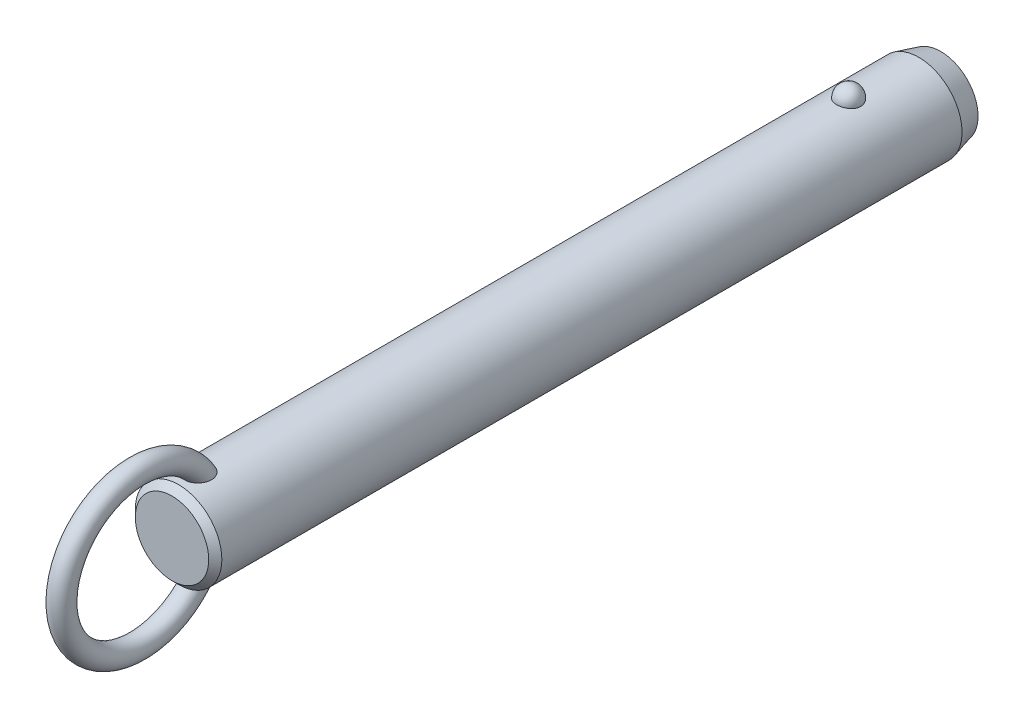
ISO-10303-21;
HEADER;
FILE_DESCRIPTION(('STEP AP214'),'2;1');
FILE_NAME('part.step','',(''),(''),'','','');
FILE_SCHEMA(('AUTOMOTIVE_DESIGN { 1 0 10303 214 1 1 1 1 }'));
ENDSEC;
DATA;
#1=APPLICATION_CONTEXT('core data for automotive mechanical design processes');
#2=APPLICATION_PROTOCOL_DEFINITION('international standard','automotive_design',2000,#1);
#3=PRODUCT_CONTEXT('',#1,'mechanical');
#4=PRODUCT('Part','Part','',(#3));
#5=PRODUCT_RELATED_PRODUCT_CATEGORY('part','',(#4));
#6=PRODUCT_DEFINITION_FORMATION('','',#4);
#7=PRODUCT_DEFINITION_CONTEXT('part definition',#1,'design');
#8=PRODUCT_DEFINITION('design','',#6,#7);
#9=PRODUCT_DEFINITION_SHAPE('','',#8);
#10=(LENGTH_UNIT() NAMED_UNIT(*) SI_UNIT(.MILLI.,.METRE.));
#11=(NAMED_UNIT(*) PLANE_ANGLE_UNIT() SI_UNIT($,.RADIAN.));
#12=(NAMED_UNIT(*) SI_UNIT($,.STERADIAN.) SOLID_ANGLE_UNIT());
#13=UNCERTAINTY_MEASURE_WITH_UNIT(LENGTH_MEASURE(1.E-05),#10,'distance_accuracy_value','');
#14=(GEOMETRIC_REPRESENTATION_CONTEXT(3) GLOBAL_UNCERTAINTY_ASSIGNED_CONTEXT((#13)) GLOBAL_UNIT_ASSIGNED_CONTEXT((#10,
#11,#12)) REPRESENTATION_CONTEXT('',''));
#15=CARTESIAN_POINT('',(0.,0.,0.));
#16=DIRECTION('',(0.,0.,1.));
#17=DIRECTION('',(1.,0.,0.));
#18=AXIS2_PLACEMENT_3D('',#15,#16,#17);
#19=CARTESIAN_POINT('',(0.,0.,111.8));
#20=DIRECTION('',(0.,0.,-1.));
#21=DIRECTION('',(-1.,0.,0.));
#22=AXIS2_PLACEMENT_3D('',#19,#20,#21);
#23=CYLINDRICAL_SURFACE('',#22,7.9);
#24=CARTESIAN_POINT('',(2.1785689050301,7.59367088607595,-2.19999999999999));
#25=CARTESIAN_POINT('',(2.17856679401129,7.59367269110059,-2.07701843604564));
#26=CARTESIAN_POINT('',(2.16853481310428,7.59657145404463,-1.95401006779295));
#27=CARTESIAN_POINT('',(2.12864689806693,7.607843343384,-1.71147811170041));
#28=CARTESIAN_POINT('',(2.09878338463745,7.61621856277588,-1.59195587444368));
#29=CARTESIAN_POINT('',(2.0199931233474,7.63749180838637,-1.3598563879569));
#30=CARTESIAN_POINT('',(1.97107475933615,7.6503878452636,-1.24727610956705));
#31=CARTESIAN_POINT('',(1.85539377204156,7.67926115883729,-1.03213234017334));
#32=CARTESIAN_POINT('',(1.78863158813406,7.69523835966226,-0.929568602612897));
#33=CARTESIAN_POINT('',(1.63856494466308,7.7285848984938,-0.736786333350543));
#34=CARTESIAN_POINT('',(1.55518140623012,7.7459606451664,-0.646630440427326));
#35=CARTESIAN_POINT('',(1.37422937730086,7.78009978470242,-0.481747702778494));
#36=CARTESIAN_POINT('',(1.27666086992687,7.79686317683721,-0.407020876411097));
#37=CARTESIAN_POINT('',(1.07024728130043,7.82786153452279,-0.275278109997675));
#38=CARTESIAN_POINT('',(0.961434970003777,7.84210353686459,-0.218212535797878));
#39=CARTESIAN_POINT('',(0.735351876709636,7.86652194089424,-0.123146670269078));
#40=CARTESIAN_POINT('',(0.618082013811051,7.87669878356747,-0.085144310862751));
#41=CARTESIAN_POINT('',(0.380637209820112,7.89170521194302,-0.0298158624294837));
#42=CARTESIAN_POINT('',(0.260550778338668,7.89662650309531,-0.0121347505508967));
#43=CARTESIAN_POINT('',(0.0190117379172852,7.90090003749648,0.00324379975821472));
#44=CARTESIAN_POINT('',(-0.102440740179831,7.90025280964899,0.00094313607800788));
#45=CARTESIAN_POINT('',(-0.341452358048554,7.89351056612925,-0.0233955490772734));
#46=CARTESIAN_POINT('',(-0.459042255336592,7.88749257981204,-0.0451545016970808));
#47=CARTESIAN_POINT('',(-0.688796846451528,7.87075812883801,-0.107408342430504));
#48=CARTESIAN_POINT('',(-0.800961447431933,7.86004158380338,-0.147903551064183));
#49=CARTESIAN_POINT('',(-1.01743634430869,7.83497131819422,-0.246799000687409));
#50=CARTESIAN_POINT('',(-1.12169791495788,7.82059709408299,-0.305300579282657));
#51=CARTESIAN_POINT('',(-1.31891765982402,7.78976470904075,-0.438549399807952));
#52=CARTESIAN_POINT('',(-1.41187469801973,7.77330633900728,-0.513298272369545));
#53=CARTESIAN_POINT('',(-1.58577142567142,7.73972434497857,-0.678622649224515));
#54=CARTESIAN_POINT('',(-1.66645140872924,7.72259402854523,-0.769470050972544));
#55=CARTESIAN_POINT('',(-1.81161503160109,7.68983776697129,-0.963538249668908));
#56=CARTESIAN_POINT('',(-1.87609753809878,7.6742119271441,-1.06675991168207));
#57=CARTESIAN_POINT('',(-1.98790138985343,7.6460202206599,-1.28401170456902));
#58=CARTESIAN_POINT('',(-2.03501994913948,7.63349104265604,-1.39815107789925));
#59=CARTESIAN_POINT('',(-2.10986724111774,7.6131449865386,-1.63301784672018));
#60=CARTESIAN_POINT('',(-2.1375965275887,7.60532797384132,-1.75374505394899));
#61=CARTESIAN_POINT('',(-2.17289256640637,7.5953195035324,-1.99782562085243));
#62=CARTESIAN_POINT('',(-2.18054294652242,7.59310471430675,-2.12116592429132));
#63=CARTESIAN_POINT('',(-2.17572919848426,7.59448538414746,-2.36741799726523));
#64=CARTESIAN_POINT('',(-2.1632656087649,7.59808068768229,-2.49032977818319));
#65=CARTESIAN_POINT('',(-2.11865035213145,7.61064035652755,-2.73161015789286));
#66=CARTESIAN_POINT('',(-2.08659579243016,7.61957823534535,-2.84999812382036));
#67=CARTESIAN_POINT('',(-2.00367799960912,7.64179982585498,-3.07955956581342));
#68=CARTESIAN_POINT('',(-1.9528140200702,7.65508371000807,-3.19073275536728));
#69=CARTESIAN_POINT('',(-1.83321113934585,7.68460381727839,-3.40337899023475));
#70=CARTESIAN_POINT('',(-1.76437735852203,7.70085556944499,-3.50479651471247));
#71=CARTESIAN_POINT('',(-1.61069526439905,7.73445734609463,-3.69446912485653));
#72=CARTESIAN_POINT('',(-1.52584634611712,7.75180741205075,-3.78272371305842));
#73=CARTESIAN_POINT('',(-1.34198059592,7.78574608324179,-3.94393987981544));
#74=CARTESIAN_POINT('',(-1.24291308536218,7.80233167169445,-4.01684434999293));
#75=CARTESIAN_POINT('',(-1.03352039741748,7.83281625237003,-4.14489386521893));
#76=CARTESIAN_POINT('',(-0.92319600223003,7.84671543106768,-4.20004014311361));
#77=CARTESIAN_POINT('',(-0.695822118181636,7.87011575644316,-4.29042017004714));
#78=CARTESIAN_POINT('',(-0.578872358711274,7.87966903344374,-4.32589112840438));
#79=CARTESIAN_POINT('',(-0.340410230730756,7.8935652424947,-4.37692226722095));
#80=CARTESIAN_POINT('',(-0.218898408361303,7.89790879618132,-4.39248482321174));
#81=CARTESIAN_POINT('',(0.0228107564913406,7.90087453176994,-4.40314405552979));
#82=CARTESIAN_POINT('',(0.142990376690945,7.89960185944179,-4.39861683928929));
#83=CARTESIAN_POINT('',(0.380829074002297,7.89171262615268,-4.37008293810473));
#84=CARTESIAN_POINT('',(0.498488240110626,7.8850962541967,-4.34607694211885));
#85=CARTESIAN_POINT('',(0.727535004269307,7.86726442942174,-4.27939317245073));
#86=CARTESIAN_POINT('',(0.838944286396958,7.85606616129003,-4.236785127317));
#87=CARTESIAN_POINT('',(1.05295421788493,7.83025654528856,-4.13408348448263));
#88=CARTESIAN_POINT('',(1.15555431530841,7.81564498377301,-4.07398879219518));
#89=CARTESIAN_POINT('',(1.35076763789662,7.7843022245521,-3.93687432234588));
#90=CARTESIAN_POINT('',(1.4432046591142,7.76754209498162,-3.85961036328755));
#91=CARTESIAN_POINT('',(1.6139111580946,7.73387857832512,-3.69076949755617));
#92=CARTESIAN_POINT('',(1.6921781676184,7.71697516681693,-3.59919010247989));
#93=CARTESIAN_POINT('',(1.83380875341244,7.6845643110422,-3.40247278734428));
#94=CARTESIAN_POINT('',(1.89689280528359,7.66908588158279,-3.29712873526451));
#95=CARTESIAN_POINT('',(2.0047823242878,7.64159441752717,-3.07707931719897));
#96=CARTESIAN_POINT('',(2.0495945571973,7.62958010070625,-2.96237743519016));
#97=CARTESIAN_POINT('',(2.11580183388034,7.61146617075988,-2.74040519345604));
#98=CARTESIAN_POINT('',(2.13929812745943,7.60484503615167,-2.63379846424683));
#99=CARTESIAN_POINT('',(2.17068242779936,7.59594664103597,-2.41813481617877));
#100=CARTESIAN_POINT('',(2.17857077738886,7.59366928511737,-2.30907795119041));
#101=CARTESIAN_POINT('',(2.1785689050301,7.59367088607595,-2.19999999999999));
#102=B_SPLINE_CURVE_WITH_KNOTS('',3,(#24,#25,#26,#27,#28,#29,#30,#31,#32,#33,#34,#35,#36,#37,
#38,#39,#40,#41,#42,#43,#44,#45,#46,#47,#48,#49,#50,#51,#52,#53,#54,#55,#56,#57,#58,#59,#60,#61,
#62,#63,#64,#65,#66,#67,#68,#69,#70,#71,#72,#73,#74,#75,#76,#77,#78,#79,#80,#81,#82,#83,#84,#85,
#86,#87,#88,#89,#90,#91,#92,#93,#94,#95,#96,#97,#98,#99,#100,#101),.UNSPECIFIED.,.T.,.F.,(4,2,2,
2,2,2,2,2,2,2,2,2,2,2,2,2,2,2,2,2,2,2,2,2,2,2,2,2,2,2,2,2,2,2,2,2,2,2,4),(0.,0.368552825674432,
0.737246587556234,1.10577831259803,1.4743009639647,1.8446206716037,2.21494081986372,
2.5842105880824,2.95344028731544,3.31611630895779,3.67875788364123,4.03628044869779,
4.39380913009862,4.75338791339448,5.11300280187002,5.47939989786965,5.8458226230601,
6.21639834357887,6.58696347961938,6.95598276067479,7.32499216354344,7.69218715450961,
8.0593967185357,8.42858578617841,8.79778880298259,9.16834203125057,9.5388695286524,
9.90482699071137,10.2707407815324,10.6298333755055,10.9889132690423,11.3466585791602,
11.7044262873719,12.0676511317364,12.4309391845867,12.8004764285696,13.1698767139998,
13.4967701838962,13.8236564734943),.UNSPECIFIED.);
#103=CARTESIAN_POINT('',(2.1785689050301,7.59367088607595,-2.19999999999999));
#104=VERTEX_POINT('',#103);
#105=EDGE_CURVE('E41',#104,#104,#102,.T.);
#106=ORIENTED_EDGE('',*,*,#105,.T.);
#107=EDGE_LOOP('',(#106));
#108=FACE_BOUND('',#107,.T.);
#109=CARTESIAN_POINT('',(0.,0.,120.12));
#110=DIRECTION('',(0.,0.,1.));
#111=DIRECTION('',(1.,0.,0.));
#112=AXIS2_PLACEMENT_3D('',#109,#110,#111);
#113=CIRCLE('',#112,7.9);
#114=CARTESIAN_POINT('',(7.9,0.,120.12));
#115=VERTEX_POINT('',#114);
#116=EDGE_CURVE('E10',#115,#115,#113,.F.);
#117=ORIENTED_EDGE('',*,*,#116,.T.);
#118=EDGE_LOOP('',(#117));
#119=FACE_BOUND('',#118,.T.);
#120=CARTESIAN_POINT('',(-0.630969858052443,-7.87476203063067,114.012432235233));
#121=CARTESIAN_POINT('',(-0.734180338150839,-7.8664899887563,114.047285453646));
#122=CARTESIAN_POINT('',(-0.834476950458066,-7.85639291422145,114.090816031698));
#123=CARTESIAN_POINT('',(-1.0262035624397,-7.83366343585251,114.194094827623));
#124=CARTESIAN_POINT('',(-1.1176141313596,-7.82102565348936,114.253877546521));
#125=CARTESIAN_POINT('',(-1.28877277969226,-7.79464922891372,114.387839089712));
#126=CARTESIAN_POINT('',(-1.36854014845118,-7.78091246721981,114.461993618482));
#127=CARTESIAN_POINT('',(-1.5146152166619,-7.75380398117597,114.622494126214));
#128=CARTESIAN_POINT('',(-1.58092966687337,-7.74043207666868,114.708833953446));
#129=CARTESIAN_POINT('',(-1.70019064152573,-7.71512522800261,114.892978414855));
#130=CARTESIAN_POINT('',(-1.75284037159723,-7.70322473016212,114.990979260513));
#131=CARTESIAN_POINT('',(-1.84263464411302,-7.68224112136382,115.194102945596));
#132=CARTESIAN_POINT('',(-1.87977299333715,-7.6731591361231,115.299228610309));
#133=CARTESIAN_POINT('',(-1.94152728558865,-7.65777930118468,115.523284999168));
#134=CARTESIAN_POINT('',(-1.96475471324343,-7.65179654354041,115.642616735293));
#135=CARTESIAN_POINT('',(-1.99449499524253,-7.64409642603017,115.88342986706));
#136=CARTESIAN_POINT('',(-2.0010005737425,-7.64238092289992,116.004912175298));
#137=CARTESIAN_POINT('',(-1.99856014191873,-7.64302120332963,116.268340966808));
#138=CARTESIAN_POINT('',(-1.98680021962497,-7.64611845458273,116.41025654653));
#139=CARTESIAN_POINT('',(-1.9445777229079,-7.65696186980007,116.691118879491));
#140=CARTESIAN_POINT('',(-1.91409393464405,-7.66471330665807,116.830062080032));
#141=CARTESIAN_POINT('',(-1.82768670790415,-7.68582947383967,117.131939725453));
#142=CARTESIAN_POINT('',(-1.76772963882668,-7.70003779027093,117.293686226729));
#143=CARTESIAN_POINT('',(-1.65998501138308,-7.72371550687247,117.527695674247));
#144=CARTESIAN_POINT('',(-1.62107967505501,-7.73200670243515,117.604297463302));
#145=CARTESIAN_POINT('',(-1.53727726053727,-7.74910377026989,117.754079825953));
#146=CARTESIAN_POINT('',(-1.49238215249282,-7.75790947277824,117.827261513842));
#147=CARTESIAN_POINT('',(-1.3739705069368,-7.77993338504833,118.00288382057));
#148=CARTESIAN_POINT('',(-1.29690364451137,-7.79328473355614,118.102955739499));
#149=CARTESIAN_POINT('',(-1.1288548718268,-7.81939266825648,118.290714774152));
#150=CARTESIAN_POINT('',(-1.0378992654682,-7.83215032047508,118.378424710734));
#151=CARTESIAN_POINT('',(-0.869532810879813,-7.85231710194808,118.513414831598));
#152=CARTESIAN_POINT('',(-0.795716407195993,-7.86021093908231,118.565076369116));
#153=CARTESIAN_POINT('',(-0.64081313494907,-7.87434920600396,118.656381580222));
#154=CARTESIAN_POINT('',(-0.559737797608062,-7.88059619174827,118.69604389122));
#155=CARTESIAN_POINT('',(-0.406456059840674,-7.88984116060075,118.754300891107));
#156=CARTESIAN_POINT('',(-0.335227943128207,-7.89321892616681,118.775384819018));
#157=CARTESIAN_POINT('',(-0.190193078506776,-7.89804235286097,118.80541418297));
#158=CARTESIAN_POINT('',(-0.116388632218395,-7.89948969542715,118.814370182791));
#159=CARTESIAN_POINT('',(0.031841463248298,-7.90028409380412,118.819291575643));
#160=CARTESIAN_POINT('',(0.106268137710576,-7.89962640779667,118.815227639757));
#161=CARTESIAN_POINT('',(0.253290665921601,-7.8962818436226,118.794461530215));
#162=CARTESIAN_POINT('',(0.325885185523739,-7.8935935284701,118.777750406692));
#163=CARTESIAN_POINT('',(0.481441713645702,-7.88577340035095,118.728738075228));
#164=CARTESIAN_POINT('',(0.563611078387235,-7.88026321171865,118.694005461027));
#165=CARTESIAN_POINT('',(0.721129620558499,-7.86741729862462,118.611796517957));
#166=CARTESIAN_POINT('',(0.796466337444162,-7.86007832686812,118.564297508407));
#167=CARTESIAN_POINT('',(0.971456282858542,-7.84073285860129,118.436513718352));
#168=CARTESIAN_POINT('',(1.06719686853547,-7.82809461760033,118.351004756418));
#169=CARTESIAN_POINT('',(1.24418921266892,-7.80192439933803,118.166232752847));
#170=CARTESIAN_POINT('',(1.32540832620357,-7.78839049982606,118.066939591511));
#171=CARTESIAN_POINT('',(1.45199971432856,-7.76559693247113,117.889576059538));
#172=CARTESIAN_POINT('',(1.50085649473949,-7.75626094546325,117.813954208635));
#173=CARTESIAN_POINT('',(1.59197749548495,-7.7380727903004,117.658742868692));
#174=CARTESIAN_POINT('',(1.63423919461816,-7.72922080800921,117.579151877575));
#175=CARTESIAN_POINT('',(1.71222612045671,-7.71231959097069,117.416664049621));
#176=CARTESIAN_POINT('',(1.74794516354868,-7.70427111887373,117.333764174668));
#177=CARTESIAN_POINT('',(1.81270113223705,-7.68929240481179,117.1652967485));
#178=CARTESIAN_POINT('',(1.84173789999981,-7.68236218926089,117.079729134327));
#179=CARTESIAN_POINT('',(1.89322698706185,-7.6698375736,116.90528702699));
#180=CARTESIAN_POINT('',(1.91558744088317,-7.66426199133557,116.816383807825));
#181=CARTESIAN_POINT('',(1.9528136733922,-7.65485915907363,116.636969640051));
#182=CARTESIAN_POINT('',(1.96767946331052,-7.65103190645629,116.546458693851));
#183=CARTESIAN_POINT('',(2.00021456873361,-7.64262981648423,116.273732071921));
#184=CARTESIAN_POINT('',(2.00600691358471,-7.6410871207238,116.089709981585));
#185=CARTESIAN_POINT('',(1.98445334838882,-7.64669564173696,115.776501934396));
#186=CARTESIAN_POINT('',(1.96607186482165,-7.65149688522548,115.646618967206));
#187=CARTESIAN_POINT('',(1.90884967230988,-7.6659762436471,115.391632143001));
#188=CARTESIAN_POINT('',(1.87002101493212,-7.67565148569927,115.266525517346));
#189=CARTESIAN_POINT('',(1.77063986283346,-7.69918471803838,115.02454013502));
#190=CARTESIAN_POINT('',(1.70993724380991,-7.71307150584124,114.907725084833));
#191=CARTESIAN_POINT('',(1.56733070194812,-7.74330306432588,114.688144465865));
#192=CARTESIAN_POINT('',(1.48543692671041,-7.75964665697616,114.585372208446));
#193=CARTESIAN_POINT('',(1.31346177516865,-7.79047523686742,114.409380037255));
#194=CARTESIAN_POINT('',(1.22547278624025,-7.80495298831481,114.334106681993));
#195=CARTESIAN_POINT('',(1.03724352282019,-7.83218597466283,114.200486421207));
#196=CARTESIAN_POINT('',(0.937008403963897,-7.84494192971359,114.142132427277));
#197=CARTESIAN_POINT('',(0.733599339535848,-7.86649045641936,114.047027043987));
#198=CARTESIAN_POINT('',(0.630941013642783,-7.87547134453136,114.009210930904));
#199=CARTESIAN_POINT('',(0.420465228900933,-7.88950708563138,113.951116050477));
#200=CARTESIAN_POINT('',(0.312645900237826,-7.89456050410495,113.93084369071));
#201=CARTESIAN_POINT('',(0.0960869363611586,-7.9001518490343,113.908455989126));
#202=CARTESIAN_POINT('',(-0.0126341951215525,-7.90073226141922,113.906169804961));
#203=CARTESIAN_POINT('',(-0.228766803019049,-7.89742350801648,113.919367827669));
#204=CARTESIAN_POINT('',(-0.33618060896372,-7.89354403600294,113.934813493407));
#205=CARTESIAN_POINT('',(-0.473410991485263,-7.88586871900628,113.966217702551));
#206=CARTESIAN_POINT('',(-0.505257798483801,-7.88388984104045,113.974354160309));
#207=CARTESIAN_POINT('',(-0.568481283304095,-7.87958326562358,113.992208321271));
#208=CARTESIAN_POINT('',(-0.599857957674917,-7.87725556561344,114.001926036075));
#209=CARTESIAN_POINT('',(-0.630969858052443,-7.87476203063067,114.012432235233));
#210=B_SPLINE_CURVE_WITH_KNOTS('',3,(#120,#121,#122,#123,#124,#125,#126,#127,#128,#129,#130,
#131,#132,#133,#134,#135,#136,#137,#138,#139,#140,#141,#142,#143,#144,#145,#146,#147,#148,#149,
#150,#151,#152,#153,#154,#155,#156,#157,#158,#159,#160,#161,#162,#163,#164,#165,#166,#167,#168,
#169,#170,#171,#172,#173,#174,#175,#176,#177,#178,#179,#180,#181,#182,#183,#184,#185,#186,#187,
#188,#189,#190,#191,#192,#193,#194,#195,#196,#197,#198,#199,#200,#201,#202,#203,#204,#205,#206,
#207,#208,#209),.UNSPECIFIED.,.T.,.F.,(4,2,2,2,2,2,2,2,2,2,2,2,2,2,2,2,2,2,2,2,2,2,2,2,2,2,2,2,
2,2,2,2,2,2,2,2,2,2,2,2,2,2,2,2,4),(0.,0.327622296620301,0.655945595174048,0.983718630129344,
1.3113267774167,1.64554655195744,1.9798996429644,2.34365728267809,2.70757317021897,
3.13333684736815,3.55958380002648,4.07655306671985,4.33527897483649,4.59391999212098,
4.97382437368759,5.35301797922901,5.62348245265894,5.89352465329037,6.11565959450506,
6.3376009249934,6.56004255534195,6.782641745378,7.04930844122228,7.31645206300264,
7.70130871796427,8.08701995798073,8.35824509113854,8.62957365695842,8.90115735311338,
9.17274746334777,9.44791855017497,9.72308922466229,10.2715298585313,10.6638393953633,
11.0559179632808,11.4507403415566,11.845374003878,12.1936425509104,12.5417649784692,
12.8695063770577,13.1973674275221,13.5221104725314,13.8461490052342,13.9449071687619,
14.0436660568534),.UNSPECIFIED.);
#211=CARTESIAN_POINT('',(-0.630969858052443,-7.87476203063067,114.012432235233));
#212=VERTEX_POINT('',#211);
#213=EDGE_CURVE('E59',#212,#212,#210,.T.);
#214=ORIENTED_EDGE('',*,*,#213,.T.);
#215=EDGE_LOOP('',(#214));
#216=FACE_BOUND('',#215,.T.);
#217=CARTESIAN_POINT('',(-0.630969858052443,7.87476203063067,114.012432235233));
#218=CARTESIAN_POINT('',(-0.52891882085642,7.88293636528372,113.977979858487));
#219=CARTESIAN_POINT('',(-0.423745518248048,7.8893481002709,113.951915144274));
#220=CARTESIAN_POINT('',(-0.210236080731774,7.8979273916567,113.917282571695));
#221=CARTESIAN_POINT('',(-0.101893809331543,7.90008607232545,113.908751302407));
#222=CARTESIAN_POINT('',(0.114660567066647,7.89990877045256,113.909457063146));
#223=CARTESIAN_POINT('',(0.222872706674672,7.89757640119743,113.91867980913));
#224=CARTESIAN_POINT('',(0.436107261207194,7.88867538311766,113.954652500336));
#225=CARTESIAN_POINT('',(0.541131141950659,7.8821087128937,113.98139425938));
#226=CARTESIAN_POINT('',(0.745085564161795,7.86545130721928,114.051756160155));
#227=CARTESIAN_POINT('',(0.844015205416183,7.85536005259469,114.095378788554));
#228=CARTESIAN_POINT('',(1.03299167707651,7.83275153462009,114.198379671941));
#229=CARTESIAN_POINT('',(1.12303841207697,7.8202342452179,114.257758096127));
#230=CARTESIAN_POINT('',(1.29214734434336,7.79408219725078,114.390864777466));
#231=CARTESIAN_POINT('',(1.37116907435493,7.78044359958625,114.464643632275));
#232=CARTESIAN_POINT('',(1.51597677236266,7.75353170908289,114.624235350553));
#233=CARTESIAN_POINT('',(1.58176261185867,7.74025841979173,114.710048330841));
#234=CARTESIAN_POINT('',(1.70057386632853,7.71504069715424,114.893644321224));
#235=CARTESIAN_POINT('',(1.75320073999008,7.70314257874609,114.991690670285));
#236=CARTESIAN_POINT('',(1.84293767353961,7.68216822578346,115.194893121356));
#237=CARTESIAN_POINT('',(1.88004278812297,7.67309289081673,115.300051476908));
#238=CARTESIAN_POINT('',(1.9417232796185,7.6577294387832,115.524167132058));
#239=CARTESIAN_POINT('',(1.96491037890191,7.65175648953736,115.643524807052));
#240=CARTESIAN_POINT('',(1.9945689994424,7.64407702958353,115.884384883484));
#241=CARTESIAN_POINT('',(2.00103304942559,7.64237242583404,116.00588821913));
#242=CARTESIAN_POINT('',(1.99850166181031,7.64303650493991,116.269368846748));
#243=CARTESIAN_POINT('',(1.98669038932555,7.64614714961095,116.411314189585));
#244=CARTESIAN_POINT('',(1.94436120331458,7.6570170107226,116.692228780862));
#245=CARTESIAN_POINT('',(1.91382203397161,7.66478150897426,116.831194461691));
#246=CARTESIAN_POINT('',(1.82728754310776,7.68592483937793,117.133111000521));
#247=CARTESIAN_POINT('',(1.76725778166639,7.7001468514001,117.294872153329));
#248=CARTESIAN_POINT('',(1.65939700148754,7.72384204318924,117.528891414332));
#249=CARTESIAN_POINT('',(1.62045187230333,7.73213852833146,117.605494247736));
#250=CARTESIAN_POINT('',(1.5365668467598,7.74924489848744,117.755273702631));
#251=CARTESIAN_POINT('',(1.49162892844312,7.75805461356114,117.828451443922));
#252=CARTESIAN_POINT('',(1.37317698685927,7.78007342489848,118.003952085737));
#253=CARTESIAN_POINT('',(1.29612360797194,7.79341423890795,118.103911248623));
#254=CARTESIAN_POINT('',(1.12812043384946,7.81949839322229,118.29145083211));
#255=CARTESIAN_POINT('',(1.03719688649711,7.83224280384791,118.379054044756));
#256=CARTESIAN_POINT('',(0.868871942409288,7.85239026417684,118.51389715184));
#257=CARTESIAN_POINT('',(0.795056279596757,7.86027769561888,118.565511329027));
#258=CARTESIAN_POINT('',(0.640160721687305,7.87440222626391,118.656720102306));
#259=CARTESIAN_POINT('',(0.559092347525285,7.88064188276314,118.696333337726));
#260=CARTESIAN_POINT('',(0.405820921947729,7.8898738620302,118.754505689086));
#261=CARTESIAN_POINT('',(0.334594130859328,7.89324577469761,118.775552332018));
#262=CARTESIAN_POINT('',(0.189568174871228,7.89805733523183,118.805507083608));
#263=CARTESIAN_POINT('',(0.115771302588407,7.89949866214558,118.814425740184));
#264=CARTESIAN_POINT('',(-0.0324359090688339,7.90028156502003,118.81927589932));
#265=CARTESIAN_POINT('',(-0.106847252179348,7.89961843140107,118.815178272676));
#266=CARTESIAN_POINT('',(-0.253834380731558,7.8962642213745,118.794351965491));
#267=CARTESIAN_POINT('',(-0.326408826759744,7.89357170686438,118.777614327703));
#268=CARTESIAN_POINT('',(-0.48196226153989,7.88574179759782,118.728539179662));
#269=CARTESIAN_POINT('',(-0.564145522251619,7.88022507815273,118.693763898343));
#270=CARTESIAN_POINT('',(-0.72168526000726,7.8673664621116,118.611468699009));
#271=CARTESIAN_POINT('',(-0.797029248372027,7.8600213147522,118.563926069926));
#272=CARTESIAN_POINT('',(-0.972044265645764,7.84066026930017,118.436026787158));
#273=CARTESIAN_POINT('',(-1.06779803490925,7.82801274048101,118.350443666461));
#274=CARTESIAN_POINT('',(-1.24480531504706,7.80182621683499,118.165522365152));
#275=CARTESIAN_POINT('',(-1.32602618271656,7.78828530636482,118.066154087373));
#276=CARTESIAN_POINT('',(-1.45259834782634,7.76548487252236,117.888680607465));
#277=CARTESIAN_POINT('',(-1.50143856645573,7.75614818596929,117.813025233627));
#278=CARTESIAN_POINT('',(-1.59252410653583,7.7379602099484,117.657748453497));
#279=CARTESIAN_POINT('',(-1.63476690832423,7.72910910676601,117.578125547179));
#280=CARTESIAN_POINT('',(-1.71271318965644,7.71221133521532,117.415575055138));
#281=CARTESIAN_POINT('',(-1.74841047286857,7.70416543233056,117.332644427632));
#282=CARTESIAN_POINT('',(-1.81311929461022,7.68919371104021,117.164116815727));
#283=CARTESIAN_POINT('',(-1.84213067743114,7.6822679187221,117.078519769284));
#284=CARTESIAN_POINT('',(-1.89356259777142,7.66975461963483,116.904025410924));
#285=CARTESIAN_POINT('',(-1.91589165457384,7.66418586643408,116.815099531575));
#286=CARTESIAN_POINT('',(-1.95305070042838,7.65479859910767,116.635642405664));
#287=CARTESIAN_POINT('',(-1.96788069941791,7.65098008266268,116.545111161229));
#288=CARTESIAN_POINT('',(-2.00030078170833,7.64260704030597,116.272327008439));
#289=CARTESIAN_POINT('',(-2.00600576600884,7.64108760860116,116.088271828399));
#290=CARTESIAN_POINT('',(-1.98428483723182,7.64673945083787,115.775080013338));
#291=CARTESIAN_POINT('',(-1.96583698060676,7.6515575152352,115.645240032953));
#292=CARTESIAN_POINT('',(-1.9084894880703,7.66606613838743,115.390361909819));
#293=CARTESIAN_POINT('',(-1.86960376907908,7.67575338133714,115.265320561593));
#294=CARTESIAN_POINT('',(-1.77013421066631,7.69930132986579,115.023500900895));
#295=CARTESIAN_POINT('',(-1.7094048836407,7.71318991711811,114.906784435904));
#296=CARTESIAN_POINT('',(-1.56672953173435,7.74342495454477,114.687340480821));
#297=CARTESIAN_POINT('',(-1.48478316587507,7.75977144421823,114.58461321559));
#298=CARTESIAN_POINT('',(-1.31266325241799,7.79061163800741,114.408643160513));
#299=CARTESIAN_POINT('',(-1.22456383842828,7.80509908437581,114.333358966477));
#300=CARTESIAN_POINT('',(-1.03622400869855,7.83231881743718,114.199865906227));
#301=CARTESIAN_POINT('',(-0.936015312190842,7.84505551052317,114.141613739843));
#302=CARTESIAN_POINT('',(-0.798824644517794,7.85957802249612,114.077540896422));
#303=CARTESIAN_POINT('',(-0.765787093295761,7.8628682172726,114.063224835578));
#304=CARTESIAN_POINT('',(-0.698939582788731,7.86909211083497,114.036436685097));
#305=CARTESIAN_POINT('',(-0.665129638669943,7.8720258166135,114.023964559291));
#306=CARTESIAN_POINT('',(-0.630969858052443,7.87476203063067,114.012432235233));
#307=B_SPLINE_CURVE_WITH_KNOTS('',3,(#217,#218,#219,#220,#221,#222,#223,#224,#225,#226,#227,
#228,#229,#230,#231,#232,#233,#234,#235,#236,#237,#238,#239,#240,#241,#242,#243,#244,#245,#246,
#247,#248,#249,#250,#251,#252,#253,#254,#255,#256,#257,#258,#259,#260,#261,#262,#263,#264,#265,
#266,#267,#268,#269,#270,#271,#272,#273,#274,#275,#276,#277,#278,#279,#280,#281,#282,#283,#284,
#285,#286,#287,#288,#289,#290,#291,#292,#293,#294,#295,#296,#297,#298,#299,#300,#301,#302,#303,
#304,#305,#306),.UNSPECIFIED.,.T.,.F.,(4,2,2,2,2,2,2,2,2,2,2,2,2,2,2,2,2,2,2,2,2,2,2,2,2,2,2,2,
2,2,2,2,2,2,2,2,2,2,2,2,2,2,2,2,4),(0.,0.32392037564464,0.648516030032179,0.97285063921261,
1.29703380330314,1.62126473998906,1.94549915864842,2.27089401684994,2.5962920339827,
2.93059633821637,3.26500707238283,3.6288164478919,3.99278833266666,4.41865421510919,
4.84500434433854,5.36209210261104,5.62087589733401,5.87957448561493,6.2591859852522,
6.63808782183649,6.90846748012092,7.17842501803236,7.40052350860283,7.62242871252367,
7.84483086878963,8.06739077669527,8.33414615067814,8.60137921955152,8.98641454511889,
9.37230415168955,9.64358673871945,9.9149726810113,10.1866142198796,10.458262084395,
10.7334745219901,11.0086865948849,11.5572126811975,11.9494246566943,12.3413699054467,
12.7359755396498,13.1305875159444,13.4791770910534,13.82687259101,13.9353013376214,
14.0437279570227),.UNSPECIFIED.);
#308=CARTESIAN_POINT('',(-0.630969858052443,7.87476203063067,114.012432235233));
#309=VERTEX_POINT('',#308);
#310=EDGE_CURVE('E67',#309,#309,#307,.T.);
#311=ORIENTED_EDGE('',*,*,#310,.T.);
#312=EDGE_LOOP('',(#311));
#313=FACE_BOUND('',#312,.T.);
#314=CARTESIAN_POINT('',(0.,0.,-14.9999999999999));
#315=DIRECTION('',(0.,0.,-1.));
#316=DIRECTION('',(-1.,0.,0.));
#317=AXIS2_PLACEMENT_3D('',#314,#315,#316);
#318=CIRCLE('',#317,7.9);
#319=CARTESIAN_POINT('',(-7.9,0.,-14.9999999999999));
#320=VERTEX_POINT('',#319);
#321=EDGE_CURVE('E56',#320,#320,#318,.F.);
#322=ORIENTED_EDGE('',*,*,#321,.T.);
#323=EDGE_LOOP('',(#322));
#324=FACE_BOUND('',#323,.T.);
#325=ADVANCED_FACE('F37',(#108,#119,#216,#313,#324),#23,.T.);
#326=CARTESIAN_POINT('',(0.,0.,-19.));
#327=DIRECTION('',(0.,0.,-1.));
#328=DIRECTION('',(-1.,0.,0.));
#329=AXIS2_PLACEMENT_3D('',#326,#327,#328);
#330=PLANE('',#329);
#331=CARTESIAN_POINT('',(0.,0.,-19.));
#332=DIRECTION('',(0.,0.,-1.));
#333=DIRECTION('',(-1.,0.,0.));
#334=AXIS2_PLACEMENT_3D('',#331,#332,#333);
#335=CIRCLE('',#334,6.82820323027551);
#336=CARTESIAN_POINT('',(-6.82820323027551,0.,-19.));
#337=VERTEX_POINT('',#336);
#338=EDGE_CURVE('E66',#337,#337,#335,.T.);
#339=ORIENTED_EDGE('',*,*,#338,.T.);
#340=EDGE_LOOP('',(#339));
#341=FACE_BOUND('',#340,.T.);
#342=ADVANCED_FACE('F85',(#341),#330,.T.);
#343=CARTESIAN_POINT('',(0.,0.,-19.));
#344=DIRECTION('',(0.,0.,1.));
#345=DIRECTION('',(1.,0.,0.));
#346=AXIS2_PLACEMENT_3D('',#343,#344,#345);
#347=CONICAL_SURFACE('',#346,6.8282032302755,0.261799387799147);
#348=ORIENTED_EDGE('',*,*,#321,.F.);
#349=EDGE_LOOP('',(#348));
#350=FACE_BOUND('',#349,.T.);
#351=ORIENTED_EDGE('',*,*,#338,.F.);
#352=EDGE_LOOP('',(#351));
#353=FACE_BOUND('',#352,.T.);
#354=ADVANCED_FACE('F83',(#350,#353),#347,.T.);
#355=CARTESIAN_POINT('',(0.,0.,121.32));
#356=DIRECTION('',(0.,0.,1.));
#357=DIRECTION('',(1.,0.,0.));
#358=AXIS2_PLACEMENT_3D('',#355,#356,#357);
#359=PLANE('',#358);
#360=CARTESIAN_POINT('',(0.,0.,121.32));
#361=DIRECTION('',(0.,0.,1.));
#362=DIRECTION('',(1.,0.,0.));
#363=AXIS2_PLACEMENT_3D('',#360,#361,#362);
#364=CIRCLE('',#363,6.69999999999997);
#365=CARTESIAN_POINT('',(6.69999999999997,0.,121.32));
#366=VERTEX_POINT('',#365);
#367=EDGE_CURVE('E50',#366,#366,#364,.T.);
#368=ORIENTED_EDGE('',*,*,#367,.T.);
#369=EDGE_LOOP('',(#368));
#370=FACE_BOUND('',#369,.T.);
#371=ADVANCED_FACE('F77',(#370),#359,.T.);
#372=CARTESIAN_POINT('',(0.,0.,127.65));
#373=DIRECTION('',(1.,0.,0.));
#374=DIRECTION('',(0.,0.,-1.));
#375=AXIS2_PLACEMENT_3D('',#372,#373,#374);
#376=TOROIDAL_SURFACE('',#375,13.85,2.);
#377=ORIENTED_EDGE('',*,*,#310,.F.);
#378=EDGE_LOOP('',(#377));
#379=FACE_BOUND('',#378,.T.);
#380=ORIENTED_EDGE('',*,*,#213,.F.);
#381=EDGE_LOOP('',(#380));
#382=FACE_BOUND('',#381,.T.);
#383=ADVANCED_FACE('F73',(#379,#382),#376,.T.);
#384=CARTESIAN_POINT('',(0.,0.,121.32));
#385=DIRECTION('',(0.,0.,-1.));
#386=DIRECTION('',(-1.,0.,0.));
#387=AXIS2_PLACEMENT_3D('',#384,#385,#386);
#388=CONICAL_SURFACE('',#387,6.69999999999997,0.785398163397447);
#389=ORIENTED_EDGE('',*,*,#116,.F.);
#390=EDGE_LOOP('',(#389));
#391=FACE_BOUND('',#390,.T.);
#392=ORIENTED_EDGE('',*,*,#367,.F.);
#393=EDGE_LOOP('',(#392));
#394=FACE_BOUND('',#393,.T.);
#395=ADVANCED_FACE('F39',(#391,#394),#388,.T.);
#396=CARTESIAN_POINT('',(0.,7.9,-2.19999999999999));
#397=DIRECTION('',(0.,1.,0.));
#398=DIRECTION('',(0.,0.,-1.));
#399=AXIS2_PLACEMENT_3D('',#396,#397,#398);
#400=SPHERICAL_SURFACE('',#399,2.2);
#401=ORIENTED_EDGE('',*,*,#105,.F.);
#402=EDGE_LOOP('',(#401));
#403=FACE_BOUND('',#402,.T.);
#404=ADVANCED_FACE('F79',(#403),#400,.T.);
#405=CLOSED_SHELL('',(#325,#342,#354,#371,#383,#395,#404));
#406=MANIFOLD_SOLID_BREP('B2',#405);
#407=ADVANCED_BREP_SHAPE_REPRESENTATION('',(#18,#406),#14);
#408=SHAPE_DEFINITION_REPRESENTATION(#9,#407);
ENDSEC;
END-ISO-10303-21;
